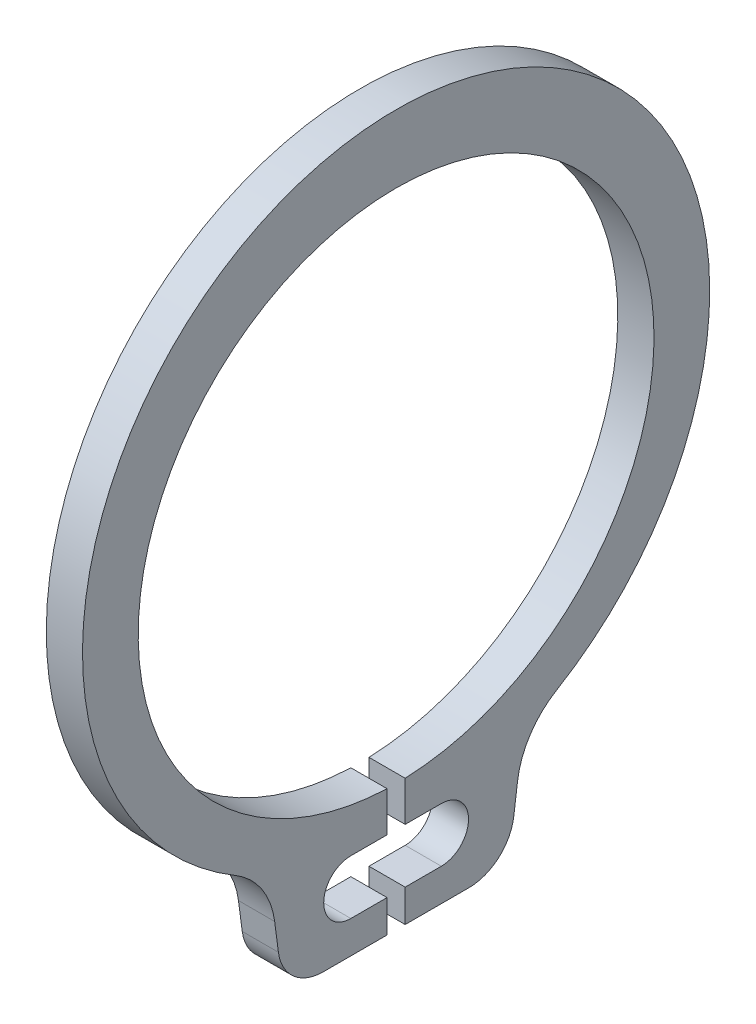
ISO-10303-21;
HEADER;
FILE_DESCRIPTION(('STEP AP214'),'2;1');
FILE_NAME('part.step','',(''),(''),'','','');
FILE_SCHEMA(('AUTOMOTIVE_DESIGN { 1 0 10303 214 1 1 1 1 }'));
ENDSEC;
DATA;
#1=APPLICATION_CONTEXT('core data for automotive mechanical design processes');
#2=APPLICATION_PROTOCOL_DEFINITION('international standard','automotive_design',2000,#1);
#3=PRODUCT_CONTEXT('',#1,'mechanical');
#4=PRODUCT('Part','Part','',(#3));
#5=PRODUCT_RELATED_PRODUCT_CATEGORY('part','',(#4));
#6=PRODUCT_DEFINITION_FORMATION('','',#4);
#7=PRODUCT_DEFINITION_CONTEXT('part definition',#1,'design');
#8=PRODUCT_DEFINITION('design','',#6,#7);
#9=PRODUCT_DEFINITION_SHAPE('','',#8);
#10=(LENGTH_UNIT() NAMED_UNIT(*) SI_UNIT(.MILLI.,.METRE.));
#11=(NAMED_UNIT(*) PLANE_ANGLE_UNIT() SI_UNIT($,.RADIAN.));
#12=(NAMED_UNIT(*) SI_UNIT($,.STERADIAN.) SOLID_ANGLE_UNIT());
#13=UNCERTAINTY_MEASURE_WITH_UNIT(LENGTH_MEASURE(1.E-05),#10,'distance_accuracy_value','');
#14=(GEOMETRIC_REPRESENTATION_CONTEXT(3) GLOBAL_UNCERTAINTY_ASSIGNED_CONTEXT((#13)) GLOBAL_UNIT_ASSIGNED_CONTEXT((#10,
#11,#12)) REPRESENTATION_CONTEXT('',''));
#15=CARTESIAN_POINT('',(0.,0.,0.));
#16=DIRECTION('',(0.,0.,1.));
#17=DIRECTION('',(1.,0.,0.));
#18=AXIS2_PLACEMENT_3D('',#15,#16,#17);
#19=CARTESIAN_POINT('',(0.2,-4.24882336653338,0.1));
#20=DIRECTION('',(0.,0.,1.));
#21=DIRECTION('',(1.,0.,0.));
#22=AXIS2_PLACEMENT_3D('',#19,#20,#21);
#23=PLANE('',#22);
#24=DIRECTION('',(0.,1.,0.));
#25=VECTOR('',#24,1.);
#26=CARTESIAN_POINT('',(0.2,-4.24882336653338,0.1));
#27=LINE('',#26,#25);
#28=CARTESIAN_POINT('',(0.2,-3.29035165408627,0.1));
#29=VERTEX_POINT('',#28);
#30=CARTESIAN_POINT('',(0.2,-2.84824507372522,0.1));
#31=VERTEX_POINT('',#30);
#32=EDGE_CURVE('E213',#29,#31,#27,.T.);
#33=ORIENTED_EDGE('',*,*,#32,.F.);
#34=DIRECTION('',(-1.,0.,0.));
#35=VECTOR('',#34,1.);
#36=CARTESIAN_POINT('',(0.2,-3.29035165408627,0.1));
#37=LINE('',#36,#35);
#38=CARTESIAN_POINT('',(-0.2,-3.29035165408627,0.1));
#39=VERTEX_POINT('',#38);
#40=EDGE_CURVE('E205',#29,#39,#37,.T.);
#41=ORIENTED_EDGE('',*,*,#40,.T.);
#42=DIRECTION('',(0.,1.,0.));
#43=VECTOR('',#42,1.);
#44=CARTESIAN_POINT('',(-0.2,-4.24882336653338,0.1));
#45=LINE('',#44,#43);
#46=CARTESIAN_POINT('',(-0.2,-2.84824507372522,0.1));
#47=VERTEX_POINT('',#46);
#48=EDGE_CURVE('E241',#39,#47,#45,.T.);
#49=ORIENTED_EDGE('',*,*,#48,.T.);
#50=DIRECTION('',(-1.,0.,0.));
#51=VECTOR('',#50,1.);
#52=CARTESIAN_POINT('',(0.2,-2.84824507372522,0.1));
#53=LINE('',#52,#51);
#54=EDGE_CURVE('E295',#31,#47,#53,.T.);
#55=ORIENTED_EDGE('',*,*,#54,.F.);
#56=EDGE_LOOP('',(#33,#41,#49,#55));
#57=FACE_BOUND('',#56,.T.);
#58=ADVANCED_FACE('F37',(#57),#23,.F.);
#59=CARTESIAN_POINT('',(0.2,-2.84824507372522,-0.1));
#60=DIRECTION('',(0.,0.,-1.));
#61=DIRECTION('',(0.,1.,0.));
#62=AXIS2_PLACEMENT_3D('',#59,#60,#61);
#63=PLANE('',#62);
#64=DIRECTION('',(0.,-1.,0.));
#65=VECTOR('',#64,1.);
#66=CARTESIAN_POINT('',(-0.2,-2.84824507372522,-0.1));
#67=LINE('',#66,#65);
#68=CARTESIAN_POINT('',(-0.2,-2.84824507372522,-0.1));
#69=VERTEX_POINT('',#68);
#70=CARTESIAN_POINT('',(-0.2,-3.29035165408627,-0.1));
#71=VERTEX_POINT('',#70);
#72=EDGE_CURVE('E248',#69,#71,#67,.T.);
#73=ORIENTED_EDGE('',*,*,#72,.T.);
#74=DIRECTION('',(1.,0.,0.));
#75=VECTOR('',#74,1.);
#76=CARTESIAN_POINT('',(0.2,-3.29035165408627,-0.1));
#77=LINE('',#76,#75);
#78=CARTESIAN_POINT('',(0.2,-3.29035165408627,-0.1));
#79=VERTEX_POINT('',#78);
#80=EDGE_CURVE('E311',#71,#79,#77,.T.);
#81=ORIENTED_EDGE('',*,*,#80,.T.);
#82=DIRECTION('',(0.,-1.,0.));
#83=VECTOR('',#82,1.);
#84=CARTESIAN_POINT('',(0.2,-2.84824507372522,-0.1));
#85=LINE('',#84,#83);
#86=CARTESIAN_POINT('',(0.2,-2.84824507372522,-0.1));
#87=VERTEX_POINT('',#86);
#88=EDGE_CURVE('E219',#87,#79,#85,.T.);
#89=ORIENTED_EDGE('',*,*,#88,.F.);
#90=DIRECTION('',(-1.,0.,0.));
#91=VECTOR('',#90,1.);
#92=CARTESIAN_POINT('',(0.2,-2.84824507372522,-0.1));
#93=LINE('',#92,#91);
#94=EDGE_CURVE('E292',#87,#69,#93,.T.);
#95=ORIENTED_EDGE('',*,*,#94,.T.);
#96=EDGE_LOOP('',(#73,#81,#89,#95));
#97=FACE_BOUND('',#96,.T.);
#98=ADVANCED_FACE('F347',(#97),#63,.F.);
#99=CARTESIAN_POINT('',(0.2,-3.74882336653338,0.804559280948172));
#100=DIRECTION('',(1.,0.,0.));
#101=DIRECTION('',(0.,0.,-1.));
#102=AXIS2_PLACEMENT_3D('',#99,#100,#101);
#103=PLANE('',#102);
#104=DIRECTION('',(0.,0.,1.));
#105=VECTOR('',#104,1.);
#106=CARTESIAN_POINT('',(0.2,-3.29035165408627,0.5));
#107=LINE('',#106,#105);
#108=CARTESIAN_POINT('',(0.2,-3.29035165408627,-0.5));
#109=VERTEX_POINT('',#108);
#110=EDGE_CURVE('E330',#109,#79,#107,.T.);
#111=ORIENTED_EDGE('',*,*,#110,.F.);
#112=CARTESIAN_POINT('',(0.2,-3.59035165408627,-0.5));
#113=DIRECTION('',(1.,0.,0.));
#114=DIRECTION('',(0.,0.,-1.));
#115=AXIS2_PLACEMENT_3D('',#112,#113,#114);
#116=CIRCLE('',#115,0.3);
#117=CARTESIAN_POINT('',(0.2,-3.89035165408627,-0.5));
#118=VERTEX_POINT('',#117);
#119=EDGE_CURVE('E200',#118,#109,#116,.T.);
#120=ORIENTED_EDGE('',*,*,#119,.F.);
#121=DIRECTION('',(0.,0.,-1.));
#122=VECTOR('',#121,1.);
#123=CARTESIAN_POINT('',(0.2,-3.89035165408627,0.5));
#124=LINE('',#123,#122);
#125=CARTESIAN_POINT('',(0.2,-3.89035165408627,-0.1));
#126=VERTEX_POINT('',#125);
#127=EDGE_CURVE('E60',#126,#118,#124,.T.);
#128=ORIENTED_EDGE('',*,*,#127,.F.);
#129=CARTESIAN_POINT('',(0.2,-4.24882336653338,-0.0999999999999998));
#130=VERTEX_POINT('',#129);
#131=EDGE_CURVE('E218',#126,#130,#85,.T.);
#132=ORIENTED_EDGE('',*,*,#131,.T.);
#133=DIRECTION('',(0.,0.,-1.));
#134=VECTOR('',#133,1.);
#135=CARTESIAN_POINT('',(0.2,-4.24882336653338,-0.0999999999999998));
#136=LINE('',#135,#134);
#137=CARTESIAN_POINT('',(0.2,-4.24882336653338,-0.804559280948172));
#138=VERTEX_POINT('',#137);
#139=EDGE_CURVE('E222',#130,#138,#136,.T.);
#140=ORIENTED_EDGE('',*,*,#139,.T.);
#141=CARTESIAN_POINT('',(0.2,-3.74882336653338,-0.804559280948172));
#142=DIRECTION('',(1.,0.,0.));
#143=DIRECTION('',(0.,0.,1.));
#144=AXIS2_PLACEMENT_3D('',#141,#142,#143);
#145=CIRCLE('',#144,0.499999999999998);
#146=CARTESIAN_POINT('',(0.2,-3.81408646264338,-1.30028171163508));
#147=VERTEX_POINT('',#146);
#148=EDGE_CURVE('E224',#138,#147,#145,.T.);
#149=ORIENTED_EDGE('',*,*,#148,.T.);
#150=DIRECTION('',(0.,0.991444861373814,-0.130526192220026));
#151=VECTOR('',#150,1.);
#152=CARTESIAN_POINT('',(0.2,-3.49800332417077,-1.34189484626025));
#153=LINE('',#152,#151);
#154=CARTESIAN_POINT('',(0.2,-3.49800332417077,-1.34189484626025));
#155=VERTEX_POINT('',#154);
#156=EDGE_CURVE('E226',#147,#155,#153,.T.);
#157=ORIENTED_EDGE('',*,*,#156,.T.);
#158=CARTESIAN_POINT('',(0.2,-3.61545742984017,-2.23404735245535));
#159=DIRECTION('',(-1.,0.,0.));
#160=DIRECTION('',(0.,0.,-1.));
#161=AXIS2_PLACEMENT_3D('',#158,#159,#160);
#162=CIRCLE('',#161,0.899850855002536);
#163=CARTESIAN_POINT('',(0.2,-2.84238645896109,-1.77351197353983));
#164=VERTEX_POINT('',#163);
#165=EDGE_CURVE('E228',#155,#164,#162,.T.);
#166=ORIENTED_EDGE('',*,*,#165,.T.);
#167=CARTESIAN_POINT('',(0.2,0.13469344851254,0.));
#168=DIRECTION('',(1.,0.,0.));
#169=DIRECTION('',(0.,0.,-1.));
#170=AXIS2_PLACEMENT_3D('',#167,#168,#169);
#171=CIRCLE('',#170,3.46530655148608);
#172=CARTESIAN_POINT('',(0.2,-2.84238645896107,1.77351197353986));
#173=VERTEX_POINT('',#172);
#174=EDGE_CURVE('E230',#164,#173,#171,.T.);
#175=ORIENTED_EDGE('',*,*,#174,.T.);
#176=CARTESIAN_POINT('',(0.2,-3.61545742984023,2.23404735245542));
#177=DIRECTION('',(-1.,0.,0.));
#178=DIRECTION('',(0.,0.,-1.));
#179=AXIS2_PLACEMENT_3D('',#176,#177,#178);
#180=CIRCLE('',#179,0.89985085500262);
#181=CARTESIAN_POINT('',(0.2,-3.49800332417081,1.34189484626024));
#182=VERTEX_POINT('',#181);
#183=EDGE_CURVE('E232',#173,#182,#180,.T.);
#184=ORIENTED_EDGE('',*,*,#183,.T.);
#185=DIRECTION('',(0.,-0.991444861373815,-0.13052619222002));
#186=VECTOR('',#185,1.);
#187=CARTESIAN_POINT('',(0.2,-3.49800332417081,1.34189484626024));
#188=LINE('',#187,#186);
#189=CARTESIAN_POINT('',(0.2,-3.81408646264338,1.30028171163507));
#190=VERTEX_POINT('',#189);
#191=EDGE_CURVE('E234',#182,#190,#188,.T.);
#192=ORIENTED_EDGE('',*,*,#191,.T.);
#193=CARTESIAN_POINT('',(0.2,-3.74882336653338,0.804559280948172));
#194=DIRECTION('',(1.,0.,0.));
#195=DIRECTION('',(0.,0.,-1.));
#196=AXIS2_PLACEMENT_3D('',#193,#194,#195);
#197=CIRCLE('',#196,0.499999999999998);
#198=CARTESIAN_POINT('',(0.2,-4.24882336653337,0.804559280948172));
#199=VERTEX_POINT('',#198);
#200=EDGE_CURVE('E236',#190,#199,#197,.T.);
#201=ORIENTED_EDGE('',*,*,#200,.T.);
#202=DIRECTION('',(0.,0.,-1.));
#203=VECTOR('',#202,1.);
#204=CARTESIAN_POINT('',(0.2,-4.24882336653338,0.1));
#205=LINE('',#204,#203);
#206=CARTESIAN_POINT('',(0.2,-4.24882336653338,0.1));
#207=VERTEX_POINT('',#206);
#208=EDGE_CURVE('E211',#199,#207,#205,.T.);
#209=ORIENTED_EDGE('',*,*,#208,.T.);
#210=CARTESIAN_POINT('',(0.2,-3.89035165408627,0.1));
#211=VERTEX_POINT('',#210);
#212=EDGE_CURVE('E191',#207,#211,#27,.T.);
#213=ORIENTED_EDGE('',*,*,#212,.T.);
#214=CARTESIAN_POINT('',(0.2,-3.89035165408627,0.5));
#215=VERTEX_POINT('',#214);
#216=EDGE_CURVE('E174',#215,#211,#124,.T.);
#217=ORIENTED_EDGE('',*,*,#216,.F.);
#218=CARTESIAN_POINT('',(0.2,-3.59035165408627,0.5));
#219=DIRECTION('',(1.,0.,0.));
#220=DIRECTION('',(0.,0.,-1.));
#221=AXIS2_PLACEMENT_3D('',#218,#219,#220);
#222=CIRCLE('',#221,0.3);
#223=CARTESIAN_POINT('',(0.2,-3.29035165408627,0.5));
#224=VERTEX_POINT('',#223);
#225=EDGE_CURVE('E189',#224,#215,#222,.T.);
#226=ORIENTED_EDGE('',*,*,#225,.F.);
#227=EDGE_CURVE('E192',#29,#224,#107,.T.);
#228=ORIENTED_EDGE('',*,*,#227,.F.);
#229=ORIENTED_EDGE('',*,*,#32,.T.);
#230=CARTESIAN_POINT('',(0.2,0.,0.));
#231=DIRECTION('',(-1.,0.,0.));
#232=DIRECTION('',(0.,0.,-1.));
#233=AXIS2_PLACEMENT_3D('',#230,#231,#232);
#234=CIRCLE('',#233,2.85);
#235=EDGE_CURVE('E216',#31,#87,#234,.T.);
#236=ORIENTED_EDGE('',*,*,#235,.T.);
#237=ORIENTED_EDGE('',*,*,#88,.T.);
#238=EDGE_LOOP('',(#111,#120,#128,#132,#140,#149,#157,#166,#175,#184,#192,#201,#209,#213,#217,
#226,#228,#229,#236,#237));
#239=FACE_BOUND('',#238,.T.);
#240=ADVANCED_FACE('F187',(#239),#103,.T.);
#241=CARTESIAN_POINT('',(-0.2,-3.74882336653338,0.804559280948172));
#242=DIRECTION('',(1.,0.,0.));
#243=DIRECTION('',(0.,0.,-1.));
#244=AXIS2_PLACEMENT_3D('',#241,#242,#243);
#245=PLANE('',#244);
#246=CARTESIAN_POINT('',(-0.2,-3.59035165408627,-0.5));
#247=DIRECTION('',(1.,0.,0.));
#248=DIRECTION('',(0.,0.,-1.));
#249=AXIS2_PLACEMENT_3D('',#246,#247,#248);
#250=CIRCLE('',#249,0.3);
#251=CARTESIAN_POINT('',(-0.200000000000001,-3.89035165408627,-0.5));
#252=VERTEX_POINT('',#251);
#253=CARTESIAN_POINT('',(-0.2,-3.29035165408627,-0.5));
#254=VERTEX_POINT('',#253);
#255=EDGE_CURVE('E196',#252,#254,#250,.T.);
#256=ORIENTED_EDGE('',*,*,#255,.T.);
#257=DIRECTION('',(0.,0.,1.));
#258=VECTOR('',#257,1.);
#259=CARTESIAN_POINT('',(-0.2,-3.29035165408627,0.804559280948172));
#260=LINE('',#259,#258);
#261=EDGE_CURVE('E52',#254,#71,#260,.T.);
#262=ORIENTED_EDGE('',*,*,#261,.T.);
#263=ORIENTED_EDGE('',*,*,#72,.F.);
#264=CARTESIAN_POINT('',(-0.2,0.,0.));
#265=DIRECTION('',(-1.,0.,0.));
#266=DIRECTION('',(0.,0.,-1.));
#267=AXIS2_PLACEMENT_3D('',#264,#265,#266);
#268=CIRCLE('',#267,2.85);
#269=EDGE_CURVE('E245',#47,#69,#268,.T.);
#270=ORIENTED_EDGE('',*,*,#269,.F.);
#271=ORIENTED_EDGE('',*,*,#48,.F.);
#272=CARTESIAN_POINT('',(-0.200000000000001,-3.29035165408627,0.5));
#273=VERTEX_POINT('',#272);
#274=EDGE_CURVE('E202',#39,#273,#260,.T.);
#275=ORIENTED_EDGE('',*,*,#274,.T.);
#276=CARTESIAN_POINT('',(-0.2,-3.59035165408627,0.5));
#277=DIRECTION('',(1.,0.,0.));
#278=DIRECTION('',(0.,0.,-1.));
#279=AXIS2_PLACEMENT_3D('',#276,#277,#278);
#280=CIRCLE('',#279,0.3);
#281=CARTESIAN_POINT('',(-0.2,-3.89035165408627,0.5));
#282=VERTEX_POINT('',#281);
#283=EDGE_CURVE('E197',#273,#282,#280,.T.);
#284=ORIENTED_EDGE('',*,*,#283,.T.);
#285=DIRECTION('',(0.,0.,-1.));
#286=VECTOR('',#285,1.);
#287=CARTESIAN_POINT('',(-0.2,-3.89035165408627,0.804559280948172));
#288=LINE('',#287,#286);
#289=CARTESIAN_POINT('',(-0.2,-3.89035165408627,0.1));
#290=VERTEX_POINT('',#289);
#291=EDGE_CURVE('E177',#282,#290,#288,.T.);
#292=ORIENTED_EDGE('',*,*,#291,.T.);
#293=CARTESIAN_POINT('',(-0.2,-4.24882336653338,0.1));
#294=VERTEX_POINT('',#293);
#295=EDGE_CURVE('E242',#294,#290,#45,.T.);
#296=ORIENTED_EDGE('',*,*,#295,.F.);
#297=DIRECTION('',(0.,0.,-1.));
#298=VECTOR('',#297,1.);
#299=CARTESIAN_POINT('',(-0.2,-4.24882336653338,0.1));
#300=LINE('',#299,#298);
#301=CARTESIAN_POINT('',(-0.2,-4.24882336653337,0.804559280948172));
#302=VERTEX_POINT('',#301);
#303=EDGE_CURVE('E209',#302,#294,#300,.T.);
#304=ORIENTED_EDGE('',*,*,#303,.F.);
#305=CARTESIAN_POINT('',(-0.2,-3.74882336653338,0.804559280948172));
#306=DIRECTION('',(1.,0.,0.));
#307=DIRECTION('',(0.,0.,-1.));
#308=AXIS2_PLACEMENT_3D('',#305,#306,#307);
#309=CIRCLE('',#308,0.499999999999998);
#310=CARTESIAN_POINT('',(-0.2,-3.81408646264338,1.30028171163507));
#311=VERTEX_POINT('',#310);
#312=EDGE_CURVE('E214',#311,#302,#309,.T.);
#313=ORIENTED_EDGE('',*,*,#312,.F.);
#314=DIRECTION('',(0.,-0.991444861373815,-0.13052619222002));
#315=VECTOR('',#314,1.);
#316=CARTESIAN_POINT('',(-0.2,-3.49800332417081,1.34189484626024));
#317=LINE('',#316,#315);
#318=CARTESIAN_POINT('',(-0.2,-3.49800332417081,1.34189484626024));
#319=VERTEX_POINT('',#318);
#320=EDGE_CURVE('E263',#319,#311,#317,.T.);
#321=ORIENTED_EDGE('',*,*,#320,.F.);
#322=CARTESIAN_POINT('',(-0.2,-3.61545742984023,2.23404735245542));
#323=DIRECTION('',(-1.,0.,0.));
#324=DIRECTION('',(0.,0.,-1.));
#325=AXIS2_PLACEMENT_3D('',#322,#323,#324);
#326=CIRCLE('',#325,0.89985085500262);
#327=CARTESIAN_POINT('',(-0.2,-2.84238645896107,1.77351197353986));
#328=VERTEX_POINT('',#327);
#329=EDGE_CURVE('E261',#328,#319,#326,.T.);
#330=ORIENTED_EDGE('',*,*,#329,.F.);
#331=CARTESIAN_POINT('',(-0.2,0.13469344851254,0.));
#332=DIRECTION('',(1.,0.,0.));
#333=DIRECTION('',(0.,0.,-1.));
#334=AXIS2_PLACEMENT_3D('',#331,#332,#333);
#335=CIRCLE('',#334,3.46530655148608);
#336=CARTESIAN_POINT('',(-0.2,-2.84238645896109,-1.77351197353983));
#337=VERTEX_POINT('',#336);
#338=EDGE_CURVE('E259',#337,#328,#335,.T.);
#339=ORIENTED_EDGE('',*,*,#338,.F.);
#340=CARTESIAN_POINT('',(-0.2,-3.61545742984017,-2.23404735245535));
#341=DIRECTION('',(-1.,0.,0.));
#342=DIRECTION('',(0.,0.,-1.));
#343=AXIS2_PLACEMENT_3D('',#340,#341,#342);
#344=CIRCLE('',#343,0.899850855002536);
#345=CARTESIAN_POINT('',(-0.2,-3.49800332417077,-1.34189484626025));
#346=VERTEX_POINT('',#345);
#347=EDGE_CURVE('E257',#346,#337,#344,.T.);
#348=ORIENTED_EDGE('',*,*,#347,.F.);
#349=DIRECTION('',(0.,0.991444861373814,-0.130526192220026));
#350=VECTOR('',#349,1.);
#351=CARTESIAN_POINT('',(-0.2,-3.49800332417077,-1.34189484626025));
#352=LINE('',#351,#350);
#353=CARTESIAN_POINT('',(-0.2,-3.81408646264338,-1.30028171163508));
#354=VERTEX_POINT('',#353);
#355=EDGE_CURVE('E255',#354,#346,#352,.T.);
#356=ORIENTED_EDGE('',*,*,#355,.F.);
#357=CARTESIAN_POINT('',(-0.2,-3.74882336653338,-0.804559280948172));
#358=DIRECTION('',(1.,0.,0.));
#359=DIRECTION('',(0.,0.,1.));
#360=AXIS2_PLACEMENT_3D('',#357,#358,#359);
#361=CIRCLE('',#360,0.499999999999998);
#362=CARTESIAN_POINT('',(-0.2,-4.24882336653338,-0.804559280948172));
#363=VERTEX_POINT('',#362);
#364=EDGE_CURVE('E253',#363,#354,#361,.T.);
#365=ORIENTED_EDGE('',*,*,#364,.F.);
#366=DIRECTION('',(0.,0.,-1.));
#367=VECTOR('',#366,1.);
#368=CARTESIAN_POINT('',(-0.2,-4.24882336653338,-0.0999999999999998));
#369=LINE('',#368,#367);
#370=CARTESIAN_POINT('',(-0.2,-4.24882336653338,-0.0999999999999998));
#371=VERTEX_POINT('',#370);
#372=EDGE_CURVE('E251',#371,#363,#369,.T.);
#373=ORIENTED_EDGE('',*,*,#372,.F.);
#374=CARTESIAN_POINT('',(-0.2,-3.89035165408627,-0.0999999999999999));
#375=VERTEX_POINT('',#374);
#376=EDGE_CURVE('E247',#375,#371,#67,.T.);
#377=ORIENTED_EDGE('',*,*,#376,.F.);
#378=EDGE_CURVE('E314',#375,#252,#288,.T.);
#379=ORIENTED_EDGE('',*,*,#378,.T.);
#380=EDGE_LOOP('',(#256,#262,#263,#270,#271,#275,#284,#292,#296,#304,#313,#321,#330,#339,#348,
#356,#365,#373,#377,#379));
#381=FACE_BOUND('',#380,.T.);
#382=ADVANCED_FACE('F308',(#381),#245,.F.);
#383=CARTESIAN_POINT('',(0.2,-4.24882336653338,0.1));
#384=DIRECTION('',(0.,1.,0.));
#385=DIRECTION('',(0.,0.,1.));
#386=AXIS2_PLACEMENT_3D('',#383,#384,#385);
#387=PLANE('',#386);
#388=ORIENTED_EDGE('',*,*,#303,.T.);
#389=DIRECTION('',(-1.,0.,0.));
#390=VECTOR('',#389,1.);
#391=CARTESIAN_POINT('',(0.2,-4.24882336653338,0.1));
#392=LINE('',#391,#390);
#393=EDGE_CURVE('E182',#207,#294,#392,.T.);
#394=ORIENTED_EDGE('',*,*,#393,.F.);
#395=ORIENTED_EDGE('',*,*,#208,.F.);
#396=DIRECTION('',(-1.,0.,0.));
#397=VECTOR('',#396,1.);
#398=CARTESIAN_POINT('',(0.2,-4.24882336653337,0.804559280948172));
#399=LINE('',#398,#397);
#400=EDGE_CURVE('E238',#199,#302,#399,.T.);
#401=ORIENTED_EDGE('',*,*,#400,.T.);
#402=EDGE_LOOP('',(#388,#394,#395,#401));
#403=FACE_BOUND('',#402,.T.);
#404=ADVANCED_FACE('F39',(#403),#387,.F.);
#405=ORIENTED_EDGE('',*,*,#295,.T.);
#406=DIRECTION('',(1.,0.,0.));
#407=VECTOR('',#406,1.);
#408=CARTESIAN_POINT('',(0.2,-3.89035165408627,0.1));
#409=LINE('',#408,#407);
#410=EDGE_CURVE('E312',#290,#211,#409,.T.);
#411=ORIENTED_EDGE('',*,*,#410,.T.);
#412=ORIENTED_EDGE('',*,*,#212,.F.);
#413=ORIENTED_EDGE('',*,*,#393,.T.);
#414=EDGE_LOOP('',(#405,#411,#412,#413));
#415=FACE_BOUND('',#414,.T.);
#416=ADVANCED_FACE('F301',(#415),#23,.F.);
#417=CARTESIAN_POINT('',(0.2,0.,0.));
#418=DIRECTION('',(-1.,0.,0.));
#419=DIRECTION('',(0.,0.,1.));
#420=AXIS2_PLACEMENT_3D('',#417,#418,#419);
#421=CYLINDRICAL_SURFACE('',#420,2.85);
#422=ORIENTED_EDGE('',*,*,#269,.T.);
#423=ORIENTED_EDGE('',*,*,#94,.F.);
#424=ORIENTED_EDGE('',*,*,#235,.F.);
#425=ORIENTED_EDGE('',*,*,#54,.T.);
#426=EDGE_LOOP('',(#422,#423,#424,#425));
#427=FACE_BOUND('',#426,.T.);
#428=ADVANCED_FACE('F343',(#427),#421,.F.);
#429=ORIENTED_EDGE('',*,*,#131,.F.);
#430=DIRECTION('',(-1.,0.,0.));
#431=VECTOR('',#430,1.);
#432=CARTESIAN_POINT('',(0.2,-3.89035165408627,-0.0999999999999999));
#433=LINE('',#432,#431);
#434=EDGE_CURVE('E320',#126,#375,#433,.T.);
#435=ORIENTED_EDGE('',*,*,#434,.T.);
#436=ORIENTED_EDGE('',*,*,#376,.T.);
#437=DIRECTION('',(-1.,0.,0.));
#438=VECTOR('',#437,1.);
#439=CARTESIAN_POINT('',(0.2,-4.24882336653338,-0.0999999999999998));
#440=LINE('',#439,#438);
#441=EDGE_CURVE('E289',#130,#371,#440,.T.);
#442=ORIENTED_EDGE('',*,*,#441,.F.);
#443=EDGE_LOOP('',(#429,#435,#436,#442));
#444=FACE_BOUND('',#443,.T.);
#445=ADVANCED_FACE('F353',(#444),#63,.F.);
#446=CARTESIAN_POINT('',(0.2,-4.24882336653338,-0.0999999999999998));
#447=DIRECTION('',(0.,1.,0.));
#448=DIRECTION('',(0.,0.,1.));
#449=AXIS2_PLACEMENT_3D('',#446,#447,#448);
#450=PLANE('',#449);
#451=ORIENTED_EDGE('',*,*,#372,.T.);
#452=DIRECTION('',(-1.,0.,0.));
#453=VECTOR('',#452,1.);
#454=CARTESIAN_POINT('',(0.2,-4.24882336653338,-0.804559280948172));
#455=LINE('',#454,#453);
#456=EDGE_CURVE('E286',#138,#363,#455,.T.);
#457=ORIENTED_EDGE('',*,*,#456,.F.);
#458=ORIENTED_EDGE('',*,*,#139,.F.);
#459=ORIENTED_EDGE('',*,*,#441,.T.);
#460=EDGE_LOOP('',(#451,#457,#458,#459));
#461=FACE_BOUND('',#460,.T.);
#462=ADVANCED_FACE('F358',(#461),#450,.F.);
#463=CARTESIAN_POINT('',(0.2,-3.74882336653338,-0.804559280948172));
#464=DIRECTION('',(-1.,0.,0.));
#465=DIRECTION('',(0.,0.,1.));
#466=AXIS2_PLACEMENT_3D('',#463,#464,#465);
#467=CYLINDRICAL_SURFACE('',#466,0.499999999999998);
#468=ORIENTED_EDGE('',*,*,#364,.T.);
#469=DIRECTION('',(-1.,0.,0.));
#470=VECTOR('',#469,1.);
#471=CARTESIAN_POINT('',(0.2,-3.81408646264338,-1.30028171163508));
#472=LINE('',#471,#470);
#473=EDGE_CURVE('E283',#147,#354,#472,.T.);
#474=ORIENTED_EDGE('',*,*,#473,.F.);
#475=ORIENTED_EDGE('',*,*,#148,.F.);
#476=ORIENTED_EDGE('',*,*,#456,.T.);
#477=EDGE_LOOP('',(#468,#474,#475,#476));
#478=FACE_BOUND('',#477,.T.);
#479=ADVANCED_FACE('F364',(#478),#467,.T.);
#480=CARTESIAN_POINT('',(0.2,-3.49800332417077,-1.34189484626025));
#481=DIRECTION('',(0.,0.130526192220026,0.991444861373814));
#482=DIRECTION('',(0.,-0.991444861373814,0.130526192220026));
#483=AXIS2_PLACEMENT_3D('',#480,#481,#482);
#484=PLANE('',#483);
#485=ORIENTED_EDGE('',*,*,#355,.T.);
#486=DIRECTION('',(-1.,0.,0.));
#487=VECTOR('',#486,1.);
#488=CARTESIAN_POINT('',(0.2,-3.49800332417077,-1.34189484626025));
#489=LINE('',#488,#487);
#490=EDGE_CURVE('E280',#155,#346,#489,.T.);
#491=ORIENTED_EDGE('',*,*,#490,.F.);
#492=ORIENTED_EDGE('',*,*,#156,.F.);
#493=ORIENTED_EDGE('',*,*,#473,.T.);
#494=EDGE_LOOP('',(#485,#491,#492,#493));
#495=FACE_BOUND('',#494,.T.);
#496=ADVANCED_FACE('F368',(#495),#484,.F.);
#497=CARTESIAN_POINT('',(0.2,-3.61545742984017,-2.23404735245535));
#498=DIRECTION('',(-1.,0.,0.));
#499=DIRECTION('',(0.,0.,1.));
#500=AXIS2_PLACEMENT_3D('',#497,#498,#499);
#501=CYLINDRICAL_SURFACE('',#500,0.899850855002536);
#502=ORIENTED_EDGE('',*,*,#347,.T.);
#503=DIRECTION('',(-1.,0.,0.));
#504=VECTOR('',#503,1.);
#505=CARTESIAN_POINT('',(0.2,-2.84238645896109,-1.77351197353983));
#506=LINE('',#505,#504);
#507=EDGE_CURVE('E277',#164,#337,#506,.T.);
#508=ORIENTED_EDGE('',*,*,#507,.F.);
#509=ORIENTED_EDGE('',*,*,#165,.F.);
#510=ORIENTED_EDGE('',*,*,#490,.T.);
#511=EDGE_LOOP('',(#502,#508,#509,#510));
#512=FACE_BOUND('',#511,.T.);
#513=ADVANCED_FACE('F373',(#512),#501,.F.);
#514=CARTESIAN_POINT('',(0.2,0.13469344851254,0.));
#515=DIRECTION('',(-1.,0.,0.));
#516=DIRECTION('',(0.,0.,1.));
#517=AXIS2_PLACEMENT_3D('',#514,#515,#516);
#518=CYLINDRICAL_SURFACE('',#517,3.46530655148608);
#519=ORIENTED_EDGE('',*,*,#338,.T.);
#520=DIRECTION('',(-1.,0.,0.));
#521=VECTOR('',#520,1.);
#522=CARTESIAN_POINT('',(0.2,-2.84238645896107,1.77351197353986));
#523=LINE('',#522,#521);
#524=EDGE_CURVE('E274',#173,#328,#523,.T.);
#525=ORIENTED_EDGE('',*,*,#524,.F.);
#526=ORIENTED_EDGE('',*,*,#174,.F.);
#527=ORIENTED_EDGE('',*,*,#507,.T.);
#528=EDGE_LOOP('',(#519,#525,#526,#527));
#529=FACE_BOUND('',#528,.T.);
#530=ADVANCED_FACE('F379',(#529),#518,.T.);
#531=CARTESIAN_POINT('',(0.2,-3.61545742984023,2.23404735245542));
#532=DIRECTION('',(-1.,0.,0.));
#533=DIRECTION('',(0.,0.,1.));
#534=AXIS2_PLACEMENT_3D('',#531,#532,#533);
#535=CYLINDRICAL_SURFACE('',#534,0.89985085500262);
#536=ORIENTED_EDGE('',*,*,#329,.T.);
#537=DIRECTION('',(-1.,0.,0.));
#538=VECTOR('',#537,1.);
#539=CARTESIAN_POINT('',(0.2,-3.49800332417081,1.34189484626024));
#540=LINE('',#539,#538);
#541=EDGE_CURVE('E271',#182,#319,#540,.T.);
#542=ORIENTED_EDGE('',*,*,#541,.F.);
#543=ORIENTED_EDGE('',*,*,#183,.F.);
#544=ORIENTED_EDGE('',*,*,#524,.T.);
#545=EDGE_LOOP('',(#536,#542,#543,#544));
#546=FACE_BOUND('',#545,.T.);
#547=ADVANCED_FACE('F383',(#546),#535,.F.);
#548=CARTESIAN_POINT('',(0.2,-3.49800332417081,1.34189484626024));
#549=DIRECTION('',(0.,0.13052619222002,-0.991444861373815));
#550=DIRECTION('',(0.,0.991444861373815,0.13052619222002));
#551=AXIS2_PLACEMENT_3D('',#548,#549,#550);
#552=PLANE('',#551);
#553=ORIENTED_EDGE('',*,*,#320,.T.);
#554=DIRECTION('',(-1.,0.,0.));
#555=VECTOR('',#554,1.);
#556=CARTESIAN_POINT('',(0.2,-3.81408646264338,1.30028171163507));
#557=LINE('',#556,#555);
#558=EDGE_CURVE('E268',#190,#311,#557,.T.);
#559=ORIENTED_EDGE('',*,*,#558,.F.);
#560=ORIENTED_EDGE('',*,*,#191,.F.);
#561=ORIENTED_EDGE('',*,*,#541,.T.);
#562=EDGE_LOOP('',(#553,#559,#560,#561));
#563=FACE_BOUND('',#562,.T.);
#564=ADVANCED_FACE('F387',(#563),#552,.F.);
#565=CARTESIAN_POINT('',(0.2,-3.74882336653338,0.804559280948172));
#566=DIRECTION('',(-1.,0.,0.));
#567=DIRECTION('',(0.,0.,1.));
#568=AXIS2_PLACEMENT_3D('',#565,#566,#567);
#569=CYLINDRICAL_SURFACE('',#568,0.499999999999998);
#570=ORIENTED_EDGE('',*,*,#312,.T.);
#571=ORIENTED_EDGE('',*,*,#400,.F.);
#572=ORIENTED_EDGE('',*,*,#200,.F.);
#573=ORIENTED_EDGE('',*,*,#558,.T.);
#574=EDGE_LOOP('',(#570,#571,#572,#573));
#575=FACE_BOUND('',#574,.T.);
#576=ADVANCED_FACE('F390',(#575),#569,.T.);
#577=CARTESIAN_POINT('',(0.2,-3.59035165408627,-0.5));
#578=DIRECTION('',(-1.,0.,0.));
#579=DIRECTION('',(0.,0.,1.));
#580=AXIS2_PLACEMENT_3D('',#577,#578,#579);
#581=CYLINDRICAL_SURFACE('',#580,0.3);
#582=DIRECTION('',(1.,0.,0.));
#583=VECTOR('',#582,1.);
#584=CARTESIAN_POINT('',(-9.8,-3.29035165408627,-0.5));
#585=LINE('',#584,#583);
#586=EDGE_CURVE('E324',#254,#109,#585,.T.);
#587=ORIENTED_EDGE('',*,*,#586,.F.);
#588=ORIENTED_EDGE('',*,*,#255,.F.);
#589=DIRECTION('',(1.,0.,0.));
#590=VECTOR('',#589,1.);
#591=CARTESIAN_POINT('',(-9.8,-3.89035165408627,-0.5));
#592=LINE('',#591,#590);
#593=EDGE_CURVE('E327',#252,#118,#592,.T.);
#594=ORIENTED_EDGE('',*,*,#593,.T.);
#595=ORIENTED_EDGE('',*,*,#119,.T.);
#596=EDGE_LOOP('',(#587,#588,#594,#595));
#597=FACE_BOUND('',#596,.T.);
#598=ADVANCED_FACE('F351',(#597),#581,.F.);
#599=CARTESIAN_POINT('',(0.2,-3.59035165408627,0.5));
#600=DIRECTION('',(-1.,0.,0.));
#601=DIRECTION('',(0.,0.,1.));
#602=AXIS2_PLACEMENT_3D('',#599,#600,#601);
#603=CYLINDRICAL_SURFACE('',#602,0.3);
#604=DIRECTION('',(-1.,0.,0.));
#605=VECTOR('',#604,1.);
#606=CARTESIAN_POINT('',(0.2,-3.29035165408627,0.5));
#607=LINE('',#606,#605);
#608=EDGE_CURVE('E11',#224,#273,#607,.T.);
#609=ORIENTED_EDGE('',*,*,#608,.F.);
#610=ORIENTED_EDGE('',*,*,#225,.T.);
#611=DIRECTION('',(-1.,0.,0.));
#612=VECTOR('',#611,1.);
#613=CARTESIAN_POINT('',(0.2,-3.89035165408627,0.5));
#614=LINE('',#613,#612);
#615=EDGE_CURVE('E45',#215,#282,#614,.T.);
#616=ORIENTED_EDGE('',*,*,#615,.T.);
#617=ORIENTED_EDGE('',*,*,#283,.F.);
#618=EDGE_LOOP('',(#609,#610,#616,#617));
#619=FACE_BOUND('',#618,.T.);
#620=ADVANCED_FACE('F195',(#619),#603,.F.);
#621=CARTESIAN_POINT('',(-9.8,-3.89035165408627,0.5));
#622=DIRECTION('',(0.,-1.,0.));
#623=DIRECTION('',(0.,0.,-1.));
#624=AXIS2_PLACEMENT_3D('',#621,#622,#623);
#625=PLANE('',#624);
#626=ORIENTED_EDGE('',*,*,#615,.F.);
#627=ORIENTED_EDGE('',*,*,#216,.T.);
#628=ORIENTED_EDGE('',*,*,#410,.F.);
#629=ORIENTED_EDGE('',*,*,#291,.F.);
#630=EDGE_LOOP('',(#626,#627,#628,#629));
#631=FACE_BOUND('',#630,.T.);
#632=ADVANCED_FACE('F173',(#631),#625,.F.);
#633=CARTESIAN_POINT('',(-9.8,-3.29035165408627,0.5));
#634=DIRECTION('',(0.,1.,0.));
#635=DIRECTION('',(0.,0.,1.));
#636=AXIS2_PLACEMENT_3D('',#633,#634,#635);
#637=PLANE('',#636);
#638=ORIENTED_EDGE('',*,*,#40,.F.);
#639=ORIENTED_EDGE('',*,*,#227,.T.);
#640=ORIENTED_EDGE('',*,*,#608,.T.);
#641=ORIENTED_EDGE('',*,*,#274,.F.);
#642=EDGE_LOOP('',(#638,#639,#640,#641));
#643=FACE_BOUND('',#642,.T.);
#644=ADVANCED_FACE('F333',(#643),#637,.F.);
#645=ORIENTED_EDGE('',*,*,#434,.F.);
#646=ORIENTED_EDGE('',*,*,#127,.T.);
#647=ORIENTED_EDGE('',*,*,#593,.F.);
#648=ORIENTED_EDGE('',*,*,#378,.F.);
#649=EDGE_LOOP('',(#645,#646,#647,#648));
#650=FACE_BOUND('',#649,.T.);
#651=ADVANCED_FACE('F423',(#650),#625,.F.);
#652=ORIENTED_EDGE('',*,*,#586,.T.);
#653=ORIENTED_EDGE('',*,*,#110,.T.);
#654=ORIENTED_EDGE('',*,*,#80,.F.);
#655=ORIENTED_EDGE('',*,*,#261,.F.);
#656=EDGE_LOOP('',(#652,#653,#654,#655));
#657=FACE_BOUND('',#656,.T.);
#658=ADVANCED_FACE('F349',(#657),#637,.F.);
#659=CLOSED_SHELL('',(#58,#98,#240,#382,#404,#416,#428,#445,#462,#479,#496,#513,#530,#547,#564,
#576,#598,#620,#632,#644,#651,#658));
#660=MANIFOLD_SOLID_BREP('B2',#659);
#661=ADVANCED_BREP_SHAPE_REPRESENTATION('',(#18,#660),#14);
#662=SHAPE_DEFINITION_REPRESENTATION(#9,#661);
ENDSEC;
END-ISO-10303-21;
